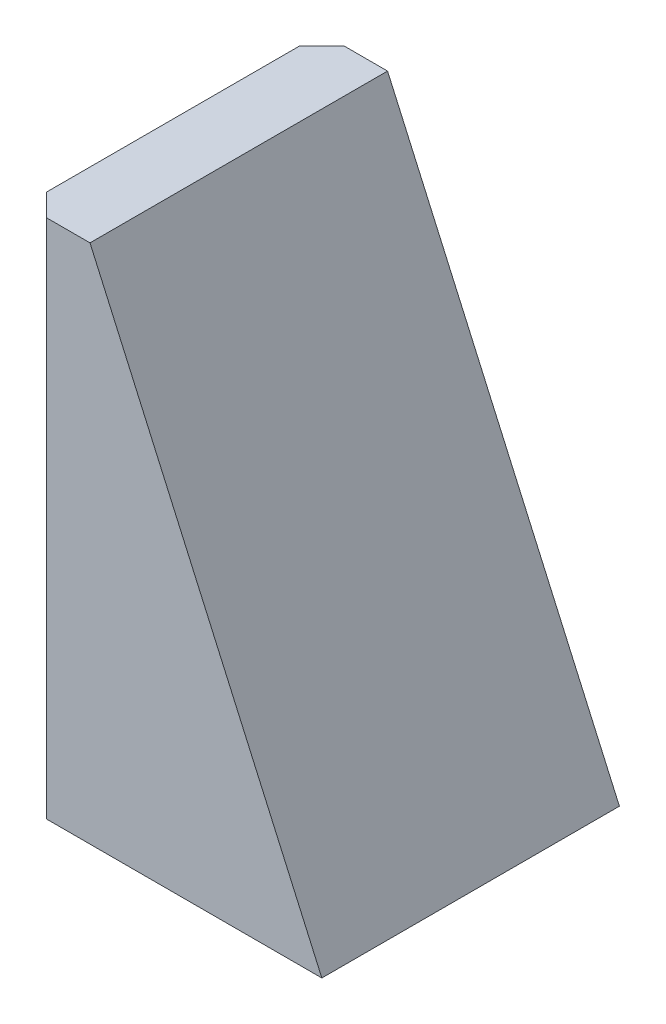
ISO-10303-21;
HEADER;
FILE_DESCRIPTION(('STEP AP214'),'2;1');
FILE_NAME('part.step','',(''),(''),'','','');
FILE_SCHEMA(('AUTOMOTIVE_DESIGN { 1 0 10303 214 1 1 1 1 }'));
ENDSEC;
DATA;
#1=APPLICATION_CONTEXT('core data for automotive mechanical design processes');
#2=APPLICATION_PROTOCOL_DEFINITION('international standard','automotive_design',2000,#1);
#3=PRODUCT_CONTEXT('',#1,'mechanical');
#4=PRODUCT('Part','Part','',(#3));
#5=PRODUCT_RELATED_PRODUCT_CATEGORY('part','',(#4));
#6=PRODUCT_DEFINITION_FORMATION('','',#4);
#7=PRODUCT_DEFINITION_CONTEXT('part definition',#1,'design');
#8=PRODUCT_DEFINITION('design','',#6,#7);
#9=PRODUCT_DEFINITION_SHAPE('','',#8);
#10=(LENGTH_UNIT() NAMED_UNIT(*) SI_UNIT(.MILLI.,.METRE.));
#11=(NAMED_UNIT(*) PLANE_ANGLE_UNIT() SI_UNIT($,.RADIAN.));
#12=(NAMED_UNIT(*) SI_UNIT($,.STERADIAN.) SOLID_ANGLE_UNIT());
#13=UNCERTAINTY_MEASURE_WITH_UNIT(LENGTH_MEASURE(1.E-05),#10,'distance_accuracy_value','');
#14=(GEOMETRIC_REPRESENTATION_CONTEXT(3) GLOBAL_UNCERTAINTY_ASSIGNED_CONTEXT((#13)) GLOBAL_UNIT_ASSIGNED_CONTEXT((#10,
#11,#12)) REPRESENTATION_CONTEXT('',''));
#15=CARTESIAN_POINT('',(0.,0.,0.));
#16=DIRECTION('',(0.,0.,1.));
#17=DIRECTION('',(1.,0.,0.));
#18=AXIS2_PLACEMENT_3D('',#15,#16,#17);
#19=CARTESIAN_POINT('',(0.,7.,4.));
#20=DIRECTION('',(1.,0.,0.));
#21=DIRECTION('',(0.,1.,0.));
#22=AXIS2_PLACEMENT_3D('',#19,#20,#21);
#23=PLANE('',#22);
#24=DIRECTION('',(0.,0.,-1.));
#25=VECTOR('',#24,1.);
#26=CARTESIAN_POINT('',(0.,7.,4.));
#27=LINE('',#26,#25);
#28=CARTESIAN_POINT('',(0.,7.,3.7));
#29=VERTEX_POINT('',#28);
#30=CARTESIAN_POINT('',(0.,7.,0.299999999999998));
#31=VERTEX_POINT('',#30);
#32=EDGE_CURVE('E129',#29,#31,#27,.T.);
#33=ORIENTED_EDGE('',*,*,#32,.T.);
#34=DIRECTION('',(0.,-1.,0.));
#35=VECTOR('',#34,1.);
#36=CARTESIAN_POINT('',(0.,7.,0.299999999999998));
#37=LINE('',#36,#35);
#38=CARTESIAN_POINT('',(0.,0.,0.299999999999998));
#39=VERTEX_POINT('',#38);
#40=EDGE_CURVE('E149',#31,#39,#37,.T.);
#41=ORIENTED_EDGE('',*,*,#40,.T.);
#42=DIRECTION('',(0.,0.,-1.));
#43=VECTOR('',#42,1.);
#44=CARTESIAN_POINT('',(0.,0.,4.));
#45=LINE('',#44,#43);
#46=CARTESIAN_POINT('',(0.,0.,3.7));
#47=VERTEX_POINT('',#46);
#48=EDGE_CURVE('E119',#47,#39,#45,.T.);
#49=ORIENTED_EDGE('',*,*,#48,.F.);
#50=DIRECTION('',(0.,1.,0.));
#51=VECTOR('',#50,1.);
#52=CARTESIAN_POINT('',(0.,7.,3.7));
#53=LINE('',#52,#51);
#54=EDGE_CURVE('E146',#47,#29,#53,.T.);
#55=ORIENTED_EDGE('',*,*,#54,.T.);
#56=EDGE_LOOP('',(#33,#41,#49,#55));
#57=FACE_BOUND('',#56,.T.);
#58=ADVANCED_FACE('F42',(#57),#23,.F.);
#59=CARTESIAN_POINT('',(0.,0.,4.));
#60=DIRECTION('',(0.,1.,0.));
#61=DIRECTION('',(0.,0.,1.));
#62=AXIS2_PLACEMENT_3D('',#59,#60,#61);
#63=PLANE('',#62);
#64=ORIENTED_EDGE('',*,*,#48,.T.);
#65=DIRECTION('',(-0.70710678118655,0.,0.707106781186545));
#66=VECTOR('',#65,1.);
#67=CARTESIAN_POINT('',(0.,0.,0.299999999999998));
#68=LINE('',#67,#66);
#69=CARTESIAN_POINT('',(0.3,0.,0.));
#70=VERTEX_POINT('',#69);
#71=EDGE_CURVE('E156',#39,#70,#68,.F.);
#72=ORIENTED_EDGE('',*,*,#71,.T.);
#73=DIRECTION('',(1.,0.,0.));
#74=VECTOR('',#73,1.);
#75=CARTESIAN_POINT('',(0.,0.,0.));
#76=LINE('',#75,#74);
#77=CARTESIAN_POINT('',(4.,0.,0.));
#78=VERTEX_POINT('',#77);
#79=EDGE_CURVE('E115',#70,#78,#76,.T.);
#80=ORIENTED_EDGE('',*,*,#79,.T.);
#81=DIRECTION('',(0.,0.,-1.));
#82=VECTOR('',#81,1.);
#83=CARTESIAN_POINT('',(4.,0.,4.));
#84=LINE('',#83,#82);
#85=CARTESIAN_POINT('',(4.,0.,4.));
#86=VERTEX_POINT('',#85);
#87=EDGE_CURVE('E112',#86,#78,#84,.T.);
#88=ORIENTED_EDGE('',*,*,#87,.F.);
#89=DIRECTION('',(1.,0.,0.));
#90=VECTOR('',#89,1.);
#91=CARTESIAN_POINT('',(0.,0.,4.));
#92=LINE('',#91,#90);
#93=CARTESIAN_POINT('',(0.299999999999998,0.,4.));
#94=VERTEX_POINT('',#93);
#95=EDGE_CURVE('E100',#94,#86,#92,.T.);
#96=ORIENTED_EDGE('',*,*,#95,.F.);
#97=DIRECTION('',(-0.707106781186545,0.,-0.70710678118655));
#98=VECTOR('',#97,1.);
#99=CARTESIAN_POINT('',(0.299999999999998,0.,4.));
#100=LINE('',#99,#98);
#101=EDGE_CURVE('E153',#94,#47,#100,.T.);
#102=ORIENTED_EDGE('',*,*,#101,.T.);
#103=EDGE_LOOP('',(#64,#72,#80,#88,#96,#102));
#104=FACE_BOUND('',#103,.T.);
#105=ADVANCED_FACE('F114',(#104),#63,.F.);
#106=CARTESIAN_POINT('',(4.,0.,4.));
#107=DIRECTION('',(-0.913545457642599,-0.406736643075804,0.));
#108=DIRECTION('',(0.406736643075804,-0.913545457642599,0.));
#109=AXIS2_PLACEMENT_3D('',#106,#107,#108);
#110=PLANE('',#109);
#111=DIRECTION('',(-0.406736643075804,0.913545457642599,0.));
#112=VECTOR('',#111,1.);
#113=CARTESIAN_POINT('',(4.,0.,0.));
#114=LINE('',#113,#112);
#115=CARTESIAN_POINT('',(0.88339920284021,7.,0.));
#116=VERTEX_POINT('',#115);
#117=EDGE_CURVE('E134',#78,#116,#114,.T.);
#118=ORIENTED_EDGE('',*,*,#117,.T.);
#119=DIRECTION('',(0.,0.,-1.));
#120=VECTOR('',#119,1.);
#121=CARTESIAN_POINT('',(0.88339920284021,7.,4.));
#122=LINE('',#121,#120);
#123=CARTESIAN_POINT('',(0.88339920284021,7.,4.));
#124=VERTEX_POINT('',#123);
#125=EDGE_CURVE('E120',#124,#116,#122,.T.);
#126=ORIENTED_EDGE('',*,*,#125,.F.);
#127=DIRECTION('',(-0.406736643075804,0.913545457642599,0.));
#128=VECTOR('',#127,1.);
#129=CARTESIAN_POINT('',(4.,0.,4.));
#130=LINE('',#129,#128);
#131=EDGE_CURVE('E104',#86,#124,#130,.T.);
#132=ORIENTED_EDGE('',*,*,#131,.F.);
#133=ORIENTED_EDGE('',*,*,#87,.T.);
#134=EDGE_LOOP('',(#118,#126,#132,#133));
#135=FACE_BOUND('',#134,.T.);
#136=ADVANCED_FACE('F122',(#135),#110,.F.);
#137=CARTESIAN_POINT('',(0.88339920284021,7.,4.));
#138=DIRECTION('',(0.,-1.,0.));
#139=DIRECTION('',(0.,0.,-1.));
#140=AXIS2_PLACEMENT_3D('',#137,#138,#139);
#141=PLANE('',#140);
#142=DIRECTION('',(-1.,0.,0.));
#143=VECTOR('',#142,1.);
#144=CARTESIAN_POINT('',(0.88339920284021,7.,0.));
#145=LINE('',#144,#143);
#146=CARTESIAN_POINT('',(0.3,7.,0.));
#147=VERTEX_POINT('',#146);
#148=EDGE_CURVE('E109',#116,#147,#145,.T.);
#149=ORIENTED_EDGE('',*,*,#148,.T.);
#150=DIRECTION('',(0.70710678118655,0.,-0.707106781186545));
#151=VECTOR('',#150,1.);
#152=CARTESIAN_POINT('',(0.,7.,0.299999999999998));
#153=LINE('',#152,#151);
#154=EDGE_CURVE('E52',#147,#31,#153,.F.);
#155=ORIENTED_EDGE('',*,*,#154,.T.);
#156=ORIENTED_EDGE('',*,*,#32,.F.);
#157=DIRECTION('',(0.707106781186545,0.,0.70710678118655));
#158=VECTOR('',#157,1.);
#159=CARTESIAN_POINT('',(0.299999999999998,7.,4.));
#160=LINE('',#159,#158);
#161=CARTESIAN_POINT('',(0.299999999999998,7.,4.));
#162=VERTEX_POINT('',#161);
#163=EDGE_CURVE('E59',#29,#162,#160,.T.);
#164=ORIENTED_EDGE('',*,*,#163,.T.);
#165=DIRECTION('',(-1.,0.,0.));
#166=VECTOR('',#165,1.);
#167=CARTESIAN_POINT('',(0.88339920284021,7.,4.));
#168=LINE('',#167,#166);
#169=EDGE_CURVE('E125',#124,#162,#168,.T.);
#170=ORIENTED_EDGE('',*,*,#169,.F.);
#171=ORIENTED_EDGE('',*,*,#125,.T.);
#172=EDGE_LOOP('',(#149,#155,#156,#164,#170,#171));
#173=FACE_BOUND('',#172,.T.);
#174=ADVANCED_FACE('F165',(#173),#141,.F.);
#175=CARTESIAN_POINT('',(0.,0.,4.));
#176=DIRECTION('',(0.,0.,1.));
#177=DIRECTION('',(1.,0.,0.));
#178=AXIS2_PLACEMENT_3D('',#175,#176,#177);
#179=PLANE('',#178);
#180=ORIENTED_EDGE('',*,*,#169,.T.);
#181=DIRECTION('',(0.,-1.,0.));
#182=VECTOR('',#181,1.);
#183=CARTESIAN_POINT('',(0.299999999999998,0.,4.));
#184=LINE('',#183,#182);
#185=EDGE_CURVE('E11',#162,#94,#184,.T.);
#186=ORIENTED_EDGE('',*,*,#185,.T.);
#187=ORIENTED_EDGE('',*,*,#95,.T.);
#188=ORIENTED_EDGE('',*,*,#131,.T.);
#189=EDGE_LOOP('',(#180,#186,#187,#188));
#190=FACE_BOUND('',#189,.T.);
#191=ADVANCED_FACE('F102',(#190),#179,.T.);
#192=CARTESIAN_POINT('',(0.,0.,0.));
#193=DIRECTION('',(0.,0.,1.));
#194=DIRECTION('',(1.,0.,0.));
#195=AXIS2_PLACEMENT_3D('',#192,#193,#194);
#196=PLANE('',#195);
#197=ORIENTED_EDGE('',*,*,#79,.F.);
#198=DIRECTION('',(0.,1.,0.));
#199=VECTOR('',#198,1.);
#200=CARTESIAN_POINT('',(0.3,0.,0.));
#201=LINE('',#200,#199);
#202=EDGE_CURVE('E67',#70,#147,#201,.T.);
#203=ORIENTED_EDGE('',*,*,#202,.T.);
#204=ORIENTED_EDGE('',*,*,#148,.F.);
#205=ORIENTED_EDGE('',*,*,#117,.F.);
#206=EDGE_LOOP('',(#197,#203,#204,#205));
#207=FACE_BOUND('',#206,.T.);
#208=ADVANCED_FACE('F172',(#207),#196,.F.);
#209=CARTESIAN_POINT('',(0.,7.,0.299999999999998));
#210=DIRECTION('',(0.707106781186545,0.,0.70710678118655));
#211=DIRECTION('',(0.,-1.,0.));
#212=AXIS2_PLACEMENT_3D('',#209,#210,#211);
#213=PLANE('',#212);
#214=ORIENTED_EDGE('',*,*,#154,.F.);
#215=ORIENTED_EDGE('',*,*,#202,.F.);
#216=ORIENTED_EDGE('',*,*,#71,.F.);
#217=ORIENTED_EDGE('',*,*,#40,.F.);
#218=EDGE_LOOP('',(#214,#215,#216,#217));
#219=FACE_BOUND('',#218,.T.);
#220=ADVANCED_FACE('F171',(#219),#213,.F.);
#221=CARTESIAN_POINT('',(0.299999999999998,0.,4.));
#222=DIRECTION('',(-0.70710678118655,0.,0.707106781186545));
#223=DIRECTION('',(0.,1.,0.));
#224=AXIS2_PLACEMENT_3D('',#221,#222,#223);
#225=PLANE('',#224);
#226=ORIENTED_EDGE('',*,*,#163,.F.);
#227=ORIENTED_EDGE('',*,*,#54,.F.);
#228=ORIENTED_EDGE('',*,*,#101,.F.);
#229=ORIENTED_EDGE('',*,*,#185,.F.);
#230=EDGE_LOOP('',(#226,#227,#228,#229));
#231=FACE_BOUND('',#230,.T.);
#232=ADVANCED_FACE('F45',(#231),#225,.T.);
#233=CLOSED_SHELL('',(#58,#105,#136,#174,#191,#208,#220,#232));
#234=MANIFOLD_SOLID_BREP('B2',#233);
#235=ADVANCED_BREP_SHAPE_REPRESENTATION('',(#18,#234),#14);
#236=SHAPE_DEFINITION_REPRESENTATION(#9,#235);
ENDSEC;
END-ISO-10303-21;
